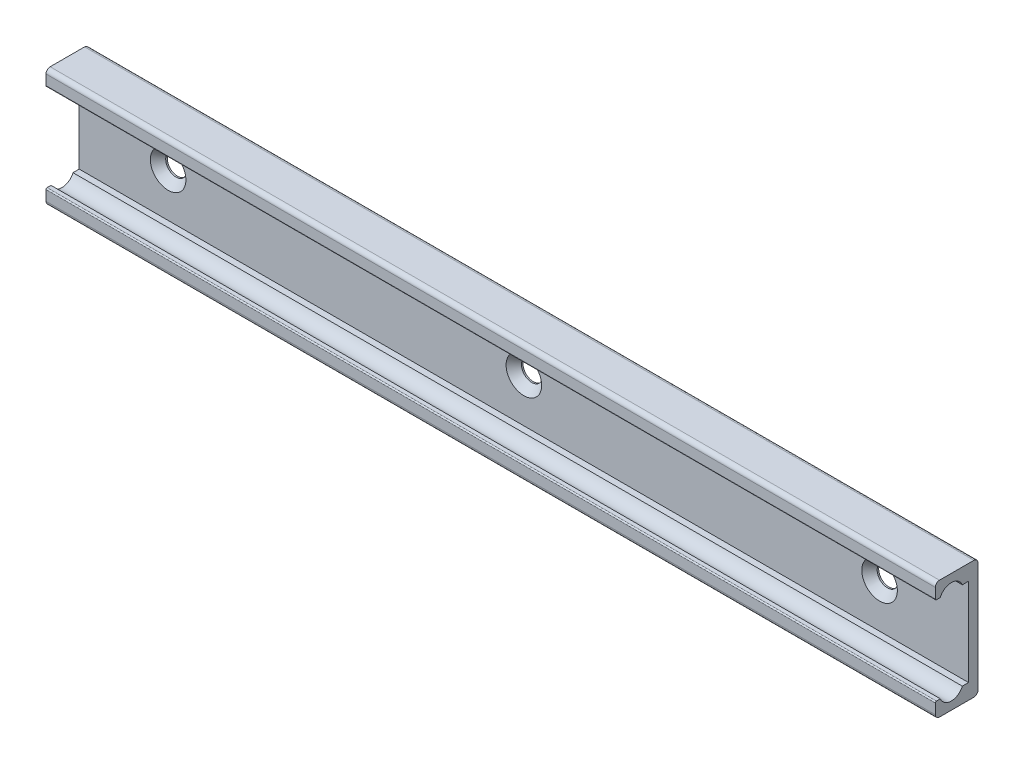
ISO-10303-21;
HEADER;
FILE_DESCRIPTION(('STEP AP214'),'2;1');
FILE_NAME('part.step','',(''),(''),'','','');
FILE_SCHEMA(('AUTOMOTIVE_DESIGN { 1 0 10303 214 1 1 1 1 }'));
ENDSEC;
DATA;
#1=APPLICATION_CONTEXT('core data for automotive mechanical design processes');
#2=APPLICATION_PROTOCOL_DEFINITION('international standard','automotive_design',2000,#1);
#3=PRODUCT_CONTEXT('',#1,'mechanical');
#4=PRODUCT('Part','Part','',(#3));
#5=PRODUCT_RELATED_PRODUCT_CATEGORY('part','',(#4));
#6=PRODUCT_DEFINITION_FORMATION('','',#4);
#7=PRODUCT_DEFINITION_CONTEXT('part definition',#1,'design');
#8=PRODUCT_DEFINITION('design','',#6,#7);
#9=PRODUCT_DEFINITION_SHAPE('','',#8);
#10=(LENGTH_UNIT() NAMED_UNIT(*) SI_UNIT(.MILLI.,.METRE.));
#11=(NAMED_UNIT(*) PLANE_ANGLE_UNIT() SI_UNIT($,.RADIAN.));
#12=(NAMED_UNIT(*) SI_UNIT($,.STERADIAN.) SOLID_ANGLE_UNIT());
#13=UNCERTAINTY_MEASURE_WITH_UNIT(LENGTH_MEASURE(1.E-05),#10,'distance_accuracy_value','');
#14=(GEOMETRIC_REPRESENTATION_CONTEXT(3) GLOBAL_UNCERTAINTY_ASSIGNED_CONTEXT((#13)) GLOBAL_UNIT_ASSIGNED_CONTEXT((#10,
#11,#12)) REPRESENTATION_CONTEXT('',''));
#15=CARTESIAN_POINT('',(0.,0.,0.));
#16=DIRECTION('',(0.,0.,1.));
#17=DIRECTION('',(1.,0.,0.));
#18=AXIS2_PLACEMENT_3D('',#15,#16,#17);
#19=CARTESIAN_POINT('',(135.,9.3,6.49999999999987));
#20=DIRECTION('',(-1.,0.,0.));
#21=DIRECTION('',(0.,0.,1.));
#22=AXIS2_PLACEMENT_3D('',#19,#20,#21);
#23=CYLINDRICAL_SURFACE('',#22,0.7);
#24=CARTESIAN_POINT('',(-15.,9.3,6.49999999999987));
#25=DIRECTION('',(-1.,0.,0.));
#26=DIRECTION('',(0.,0.,-1.));
#27=AXIS2_PLACEMENT_3D('',#24,#25,#26);
#28=CIRCLE('',#27,0.7);
#29=CARTESIAN_POINT('',(-15.,9.3,7.19999999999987));
#30=VERTEX_POINT('',#29);
#31=CARTESIAN_POINT('',(-15.,10.,6.49999999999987));
#32=VERTEX_POINT('',#31);
#33=EDGE_CURVE('E139',#30,#32,#28,.T.);
#34=ORIENTED_EDGE('',*,*,#33,.F.);
#35=DIRECTION('',(-1.,0.,0.));
#36=VECTOR('',#35,1.);
#37=CARTESIAN_POINT('',(135.,9.3,7.19999999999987));
#38=LINE('',#37,#36);
#39=CARTESIAN_POINT('',(135.,9.3,7.19999999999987));
#40=VERTEX_POINT('',#39);
#41=EDGE_CURVE('E9',#40,#30,#38,.T.);
#42=ORIENTED_EDGE('',*,*,#41,.F.);
#43=CARTESIAN_POINT('',(135.,9.3,6.49999999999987));
#44=DIRECTION('',(-1.,0.,0.));
#45=DIRECTION('',(0.,0.,-1.));
#46=AXIS2_PLACEMENT_3D('',#43,#44,#45);
#47=CIRCLE('',#46,0.7);
#48=CARTESIAN_POINT('',(135.,10.,6.49999999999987));
#49=VERTEX_POINT('',#48);
#50=EDGE_CURVE('E141',#40,#49,#47,.T.);
#51=ORIENTED_EDGE('',*,*,#50,.T.);
#52=DIRECTION('',(-1.,0.,0.));
#53=VECTOR('',#52,1.);
#54=CARTESIAN_POINT('',(135.,10.,6.49999999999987));
#55=LINE('',#54,#53);
#56=EDGE_CURVE('E136',#49,#32,#55,.T.);
#57=ORIENTED_EDGE('',*,*,#56,.T.);
#58=EDGE_LOOP('',(#34,#42,#51,#57));
#59=FACE_BOUND('',#58,.T.);
#60=ADVANCED_FACE('F14',(#59),#23,.T.);
#61=CARTESIAN_POINT('',(135.,7.60000008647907,7.19999999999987));
#62=DIRECTION('',(0.,0.,1.));
#63=DIRECTION('',(1.,0.,0.));
#64=AXIS2_PLACEMENT_3D('',#61,#62,#63);
#65=PLANE('',#64);
#66=DIRECTION('',(0.,1.,0.));
#67=VECTOR('',#66,1.);
#68=CARTESIAN_POINT('',(-15.,7.60000008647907,7.19999999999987));
#69=LINE('',#68,#67);
#70=CARTESIAN_POINT('',(-15.,7.60000008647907,7.19999999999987));
#71=VERTEX_POINT('',#70);
#72=EDGE_CURVE('E158',#71,#30,#69,.T.);
#73=ORIENTED_EDGE('',*,*,#72,.F.);
#74=DIRECTION('',(-1.,0.,0.));
#75=VECTOR('',#74,1.);
#76=CARTESIAN_POINT('',(135.,7.60000008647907,7.19999999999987));
#77=LINE('',#76,#75);
#78=CARTESIAN_POINT('',(135.,7.60000008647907,7.19999999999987));
#79=VERTEX_POINT('',#78);
#80=EDGE_CURVE('E22',#79,#71,#77,.T.);
#81=ORIENTED_EDGE('',*,*,#80,.F.);
#82=DIRECTION('',(0.,1.,0.));
#83=VECTOR('',#82,1.);
#84=CARTESIAN_POINT('',(135.,7.60000008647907,7.19999999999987));
#85=LINE('',#84,#83);
#86=EDGE_CURVE('E146',#79,#40,#85,.T.);
#87=ORIENTED_EDGE('',*,*,#86,.T.);
#88=ORIENTED_EDGE('',*,*,#41,.T.);
#89=EDGE_LOOP('',(#73,#81,#87,#88));
#90=FACE_BOUND('',#89,.T.);
#91=ADVANCED_FACE('F386',(#90),#65,.T.);
#92=CARTESIAN_POINT('',(135.,7.60000008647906,6.99999999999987));
#93=DIRECTION('',(-1.,0.,0.));
#94=DIRECTION('',(0.,0.,1.));
#95=AXIS2_PLACEMENT_3D('',#92,#93,#94);
#96=CYLINDRICAL_SURFACE('',#95,0.2);
#97=CARTESIAN_POINT('',(-15.,7.60000008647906,6.99999999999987));
#98=DIRECTION('',(-1.,0.,0.));
#99=DIRECTION('',(0.,0.,-1.));
#100=AXIS2_PLACEMENT_3D('',#97,#98,#99);
#101=CIRCLE('',#100,0.2);
#102=CARTESIAN_POINT('',(-15.,7.40000008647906,6.99999999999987));
#103=VERTEX_POINT('',#102);
#104=EDGE_CURVE('E206',#103,#71,#101,.T.);
#105=ORIENTED_EDGE('',*,*,#104,.F.);
#106=DIRECTION('',(-1.,0.,0.));
#107=VECTOR('',#106,1.);
#108=CARTESIAN_POINT('',(135.,7.40000008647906,6.99999999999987));
#109=LINE('',#108,#107);
#110=CARTESIAN_POINT('',(135.,7.40000008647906,6.99999999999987));
#111=VERTEX_POINT('',#110);
#112=EDGE_CURVE('E258',#111,#103,#109,.T.);
#113=ORIENTED_EDGE('',*,*,#112,.F.);
#114=CARTESIAN_POINT('',(135.,7.60000008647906,6.99999999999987));
#115=DIRECTION('',(-1.,0.,0.));
#116=DIRECTION('',(0.,0.,-1.));
#117=AXIS2_PLACEMENT_3D('',#114,#115,#116);
#118=CIRCLE('',#117,0.2);
#119=EDGE_CURVE('E254',#111,#79,#118,.T.);
#120=ORIENTED_EDGE('',*,*,#119,.T.);
#121=ORIENTED_EDGE('',*,*,#80,.T.);
#122=EDGE_LOOP('',(#105,#113,#120,#121));
#123=FACE_BOUND('',#122,.T.);
#124=ADVANCED_FACE('F391',(#123),#96,.T.);
#125=CARTESIAN_POINT('',(135.,7.40000008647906,6.35404949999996));
#126=DIRECTION('',(0.,-1.,0.));
#127=DIRECTION('',(1.,0.,0.));
#128=AXIS2_PLACEMENT_3D('',#125,#126,#127);
#129=PLANE('',#128);
#130=DIRECTION('',(0.,0.,1.));
#131=VECTOR('',#130,1.);
#132=CARTESIAN_POINT('',(-15.,7.40000008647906,6.35404949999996));
#133=LINE('',#132,#131);
#134=CARTESIAN_POINT('',(-15.,7.40000008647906,6.35404949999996));
#135=VERTEX_POINT('',#134);
#136=EDGE_CURVE('E203',#135,#103,#133,.T.);
#137=ORIENTED_EDGE('',*,*,#136,.F.);
#138=DIRECTION('',(-1.,0.,0.));
#139=VECTOR('',#138,1.);
#140=CARTESIAN_POINT('',(135.,7.40000008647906,6.35404949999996));
#141=LINE('',#140,#139);
#142=CARTESIAN_POINT('',(135.,7.40000008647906,6.35404949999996));
#143=VERTEX_POINT('',#142);
#144=EDGE_CURVE('E260',#143,#135,#141,.T.);
#145=ORIENTED_EDGE('',*,*,#144,.F.);
#146=DIRECTION('',(0.,0.,1.));
#147=VECTOR('',#146,1.);
#148=CARTESIAN_POINT('',(135.,7.40000008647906,6.35404949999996));
#149=LINE('',#148,#147);
#150=EDGE_CURVE('E251',#143,#111,#149,.T.);
#151=ORIENTED_EDGE('',*,*,#150,.T.);
#152=ORIENTED_EDGE('',*,*,#112,.T.);
#153=EDGE_LOOP('',(#137,#145,#151,#152));
#154=FACE_BOUND('',#153,.T.);
#155=ADVANCED_FACE('F397',(#154),#129,.T.);
#156=CARTESIAN_POINT('',(135.,6.65000008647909,4.50000000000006));
#157=DIRECTION('',(-1.,0.,0.));
#158=DIRECTION('',(0.,0.,1.));
#159=AXIS2_PLACEMENT_3D('',#156,#157,#158);
#160=CYLINDRICAL_SURFACE('',#159,1.99999988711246);
#161=CARTESIAN_POINT('',(-15.,6.65000008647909,4.50000000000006));
#162=DIRECTION('',(1.,0.,0.));
#163=DIRECTION('',(0.,0.,1.));
#164=AXIS2_PLACEMENT_3D('',#161,#162,#163);
#165=CIRCLE('',#164,1.99999988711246);
#166=CARTESIAN_POINT('',(-15.,7.40000008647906,2.64595050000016));
#167=VERTEX_POINT('',#166);
#168=EDGE_CURVE('E200',#167,#135,#165,.T.);
#169=ORIENTED_EDGE('',*,*,#168,.F.);
#170=DIRECTION('',(-1.,0.,0.));
#171=VECTOR('',#170,1.);
#172=CARTESIAN_POINT('',(135.,7.40000008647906,2.64595050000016));
#173=LINE('',#172,#171);
#174=CARTESIAN_POINT('',(135.,7.40000008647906,2.64595050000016));
#175=VERTEX_POINT('',#174);
#176=EDGE_CURVE('E262',#175,#167,#173,.T.);
#177=ORIENTED_EDGE('',*,*,#176,.F.);
#178=CARTESIAN_POINT('',(135.,6.65000008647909,4.50000000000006));
#179=DIRECTION('',(1.,0.,0.));
#180=DIRECTION('',(0.,0.,1.));
#181=AXIS2_PLACEMENT_3D('',#178,#179,#180);
#182=CIRCLE('',#181,1.99999988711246);
#183=EDGE_CURVE('E248',#175,#143,#182,.T.);
#184=ORIENTED_EDGE('',*,*,#183,.T.);
#185=ORIENTED_EDGE('',*,*,#144,.T.);
#186=EDGE_LOOP('',(#169,#177,#184,#185));
#187=FACE_BOUND('',#186,.T.);
#188=ADVANCED_FACE('F405',(#187),#160,.F.);
#189=CARTESIAN_POINT('',(135.,7.40000008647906,1.60000000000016));
#190=DIRECTION('',(0.,-1.,0.));
#191=DIRECTION('',(1.,0.,0.));
#192=AXIS2_PLACEMENT_3D('',#189,#190,#191);
#193=PLANE('',#192);
#194=DIRECTION('',(0.,0.,1.));
#195=VECTOR('',#194,1.);
#196=CARTESIAN_POINT('',(-15.,7.40000008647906,1.60000000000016));
#197=LINE('',#196,#195);
#198=CARTESIAN_POINT('',(-15.,7.40000008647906,1.60000000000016));
#199=VERTEX_POINT('',#198);
#200=EDGE_CURVE('E197',#199,#167,#197,.T.);
#201=ORIENTED_EDGE('',*,*,#200,.F.);
#202=DIRECTION('',(-1.,0.,0.));
#203=VECTOR('',#202,1.);
#204=CARTESIAN_POINT('',(135.,7.40000008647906,1.60000000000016));
#205=LINE('',#204,#203);
#206=CARTESIAN_POINT('',(135.,7.40000008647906,1.60000000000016));
#207=VERTEX_POINT('',#206);
#208=EDGE_CURVE('E264',#207,#199,#205,.T.);
#209=ORIENTED_EDGE('',*,*,#208,.F.);
#210=DIRECTION('',(0.,0.,1.));
#211=VECTOR('',#210,1.);
#212=CARTESIAN_POINT('',(135.,7.40000008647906,1.60000000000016));
#213=LINE('',#212,#211);
#214=EDGE_CURVE('E245',#207,#175,#213,.T.);
#215=ORIENTED_EDGE('',*,*,#214,.T.);
#216=ORIENTED_EDGE('',*,*,#176,.T.);
#217=EDGE_LOOP('',(#201,#209,#215,#216));
#218=FACE_BOUND('',#217,.T.);
#219=ADVANCED_FACE('F330',(#218),#193,.T.);
#220=CARTESIAN_POINT('',(135.,-7.40000008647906,1.60000000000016));
#221=DIRECTION('',(0.,0.,1.));
#222=DIRECTION('',(0.,1.,0.));
#223=AXIS2_PLACEMENT_3D('',#220,#221,#222);
#224=PLANE('',#223);
#225=CARTESIAN_POINT('',(120.,0.,1.60000000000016));
#226=DIRECTION('',(0.,0.,1.));
#227=DIRECTION('',(0.,1.,0.));
#228=AXIS2_PLACEMENT_3D('',#225,#226,#227);
#229=CIRCLE('',#228,3.);
#230=CARTESIAN_POINT('',(120.,3.,1.60000000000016));
#231=VERTEX_POINT('',#230);
#232=EDGE_CURVE('E291',#231,#231,#229,.T.);
#233=ORIENTED_EDGE('',*,*,#232,.F.);
#234=EDGE_LOOP('',(#233));
#235=FACE_BOUND('',#234,.T.);
#236=CARTESIAN_POINT('',(60.,0.,1.60000000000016));
#237=DIRECTION('',(0.,0.,1.));
#238=DIRECTION('',(0.,1.,0.));
#239=AXIS2_PLACEMENT_3D('',#236,#237,#238);
#240=CIRCLE('',#239,3.);
#241=CARTESIAN_POINT('',(60.,3.,1.60000000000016));
#242=VERTEX_POINT('',#241);
#243=EDGE_CURVE('E296',#242,#242,#240,.T.);
#244=ORIENTED_EDGE('',*,*,#243,.F.);
#245=EDGE_LOOP('',(#244));
#246=FACE_BOUND('',#245,.T.);
#247=CARTESIAN_POINT('',(0.,0.,1.60000000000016));
#248=DIRECTION('',(0.,0.,1.));
#249=DIRECTION('',(0.,1.,0.));
#250=AXIS2_PLACEMENT_3D('',#247,#248,#249);
#251=CIRCLE('',#250,3.);
#252=CARTESIAN_POINT('',(0.,3.,1.60000000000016));
#253=VERTEX_POINT('',#252);
#254=EDGE_CURVE('E159',#253,#253,#251,.T.);
#255=ORIENTED_EDGE('',*,*,#254,.F.);
#256=EDGE_LOOP('',(#255));
#257=FACE_BOUND('',#256,.T.);
#258=DIRECTION('',(0.,1.,0.));
#259=VECTOR('',#258,1.);
#260=CARTESIAN_POINT('',(-15.,-7.40000008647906,1.60000000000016));
#261=LINE('',#260,#259);
#262=CARTESIAN_POINT('',(-15.,-7.40000008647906,1.60000000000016));
#263=VERTEX_POINT('',#262);
#264=EDGE_CURVE('E194',#263,#199,#261,.T.);
#265=ORIENTED_EDGE('',*,*,#264,.F.);
#266=DIRECTION('',(-1.,0.,0.));
#267=VECTOR('',#266,1.);
#268=CARTESIAN_POINT('',(135.,-7.40000008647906,1.60000000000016));
#269=LINE('',#268,#267);
#270=CARTESIAN_POINT('',(135.,-7.40000008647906,1.60000000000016));
#271=VERTEX_POINT('',#270);
#272=EDGE_CURVE('E266',#271,#263,#269,.T.);
#273=ORIENTED_EDGE('',*,*,#272,.F.);
#274=DIRECTION('',(0.,1.,0.));
#275=VECTOR('',#274,1.);
#276=CARTESIAN_POINT('',(135.,-7.40000008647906,1.60000000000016));
#277=LINE('',#276,#275);
#278=EDGE_CURVE('E242',#271,#207,#277,.T.);
#279=ORIENTED_EDGE('',*,*,#278,.T.);
#280=ORIENTED_EDGE('',*,*,#208,.T.);
#281=EDGE_LOOP('',(#265,#273,#279,#280));
#282=FACE_BOUND('',#281,.T.);
#283=ADVANCED_FACE('F326',(#235,#246,#257,#282),#224,.T.);
#284=CARTESIAN_POINT('',(135.,-7.40000008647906,1.60000000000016));
#285=DIRECTION('',(0.,1.,0.));
#286=DIRECTION('',(-1.,0.,0.));
#287=AXIS2_PLACEMENT_3D('',#284,#285,#286);
#288=PLANE('',#287);
#289=DIRECTION('',(0.,0.,-1.));
#290=VECTOR('',#289,1.);
#291=CARTESIAN_POINT('',(-15.,-7.40000008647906,1.60000000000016));
#292=LINE('',#291,#290);
#293=CARTESIAN_POINT('',(-15.,-7.40000008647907,2.64595050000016));
#294=VERTEX_POINT('',#293);
#295=EDGE_CURVE('E191',#294,#263,#292,.T.);
#296=ORIENTED_EDGE('',*,*,#295,.F.);
#297=DIRECTION('',(-1.,0.,0.));
#298=VECTOR('',#297,1.);
#299=CARTESIAN_POINT('',(135.,-7.40000008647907,2.64595050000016));
#300=LINE('',#299,#298);
#301=CARTESIAN_POINT('',(135.,-7.40000008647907,2.64595050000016));
#302=VERTEX_POINT('',#301);
#303=EDGE_CURVE('E268',#302,#294,#300,.T.);
#304=ORIENTED_EDGE('',*,*,#303,.F.);
#305=DIRECTION('',(0.,0.,-1.));
#306=VECTOR('',#305,1.);
#307=CARTESIAN_POINT('',(135.,-7.40000008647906,1.60000000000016));
#308=LINE('',#307,#306);
#309=EDGE_CURVE('E239',#302,#271,#308,.T.);
#310=ORIENTED_EDGE('',*,*,#309,.T.);
#311=ORIENTED_EDGE('',*,*,#272,.T.);
#312=EDGE_LOOP('',(#296,#304,#310,#311));
#313=FACE_BOUND('',#312,.T.);
#314=ADVANCED_FACE('F329',(#313),#288,.T.);
#315=CARTESIAN_POINT('',(135.,-6.65000008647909,4.50000000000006));
#316=DIRECTION('',(-1.,0.,0.));
#317=DIRECTION('',(0.,0.,1.));
#318=AXIS2_PLACEMENT_3D('',#315,#316,#317);
#319=CYLINDRICAL_SURFACE('',#318,1.99999988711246);
#320=CARTESIAN_POINT('',(-15.,-6.65000008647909,4.50000000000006));
#321=DIRECTION('',(1.,0.,0.));
#322=DIRECTION('',(0.,0.,-1.));
#323=AXIS2_PLACEMENT_3D('',#320,#321,#322);
#324=CIRCLE('',#323,1.99999988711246);
#325=CARTESIAN_POINT('',(-15.,-7.40000008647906,6.35404949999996));
#326=VERTEX_POINT('',#325);
#327=EDGE_CURVE('E188',#326,#294,#324,.T.);
#328=ORIENTED_EDGE('',*,*,#327,.F.);
#329=DIRECTION('',(-1.,0.,0.));
#330=VECTOR('',#329,1.);
#331=CARTESIAN_POINT('',(135.,-7.40000008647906,6.35404949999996));
#332=LINE('',#331,#330);
#333=CARTESIAN_POINT('',(135.,-7.40000008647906,6.35404949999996));
#334=VERTEX_POINT('',#333);
#335=EDGE_CURVE('E270',#334,#326,#332,.T.);
#336=ORIENTED_EDGE('',*,*,#335,.F.);
#337=CARTESIAN_POINT('',(135.,-6.65000008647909,4.50000000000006));
#338=DIRECTION('',(1.,0.,0.));
#339=DIRECTION('',(0.,0.,-1.));
#340=AXIS2_PLACEMENT_3D('',#337,#338,#339);
#341=CIRCLE('',#340,1.99999988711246);
#342=EDGE_CURVE('E236',#334,#302,#341,.T.);
#343=ORIENTED_EDGE('',*,*,#342,.T.);
#344=ORIENTED_EDGE('',*,*,#303,.T.);
#345=EDGE_LOOP('',(#328,#336,#343,#344));
#346=FACE_BOUND('',#345,.T.);
#347=ADVANCED_FACE('F346',(#346),#319,.F.);
#348=CARTESIAN_POINT('',(135.,-7.40000008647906,6.35404949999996));
#349=DIRECTION('',(0.,1.,0.));
#350=DIRECTION('',(-1.,0.,0.));
#351=AXIS2_PLACEMENT_3D('',#348,#349,#350);
#352=PLANE('',#351);
#353=DIRECTION('',(0.,0.,-1.));
#354=VECTOR('',#353,1.);
#355=CARTESIAN_POINT('',(-15.,-7.40000008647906,6.35404949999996));
#356=LINE('',#355,#354);
#357=CARTESIAN_POINT('',(-15.,-7.40000008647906,6.99999999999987));
#358=VERTEX_POINT('',#357);
#359=EDGE_CURVE('E185',#358,#326,#356,.T.);
#360=ORIENTED_EDGE('',*,*,#359,.F.);
#361=DIRECTION('',(-1.,0.,0.));
#362=VECTOR('',#361,1.);
#363=CARTESIAN_POINT('',(135.,-7.40000008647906,6.99999999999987));
#364=LINE('',#363,#362);
#365=CARTESIAN_POINT('',(135.,-7.40000008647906,6.99999999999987));
#366=VERTEX_POINT('',#365);
#367=EDGE_CURVE('E272',#366,#358,#364,.T.);
#368=ORIENTED_EDGE('',*,*,#367,.F.);
#369=DIRECTION('',(0.,0.,-1.));
#370=VECTOR('',#369,1.);
#371=CARTESIAN_POINT('',(135.,-7.40000008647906,6.35404949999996));
#372=LINE('',#371,#370);
#373=EDGE_CURVE('E233',#366,#334,#372,.T.);
#374=ORIENTED_EDGE('',*,*,#373,.T.);
#375=ORIENTED_EDGE('',*,*,#335,.T.);
#376=EDGE_LOOP('',(#360,#368,#374,#375));
#377=FACE_BOUND('',#376,.T.);
#378=ADVANCED_FACE('F349',(#377),#352,.T.);
#379=CARTESIAN_POINT('',(135.,-7.60000008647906,6.99999999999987));
#380=DIRECTION('',(-1.,0.,0.));
#381=DIRECTION('',(0.,0.,1.));
#382=AXIS2_PLACEMENT_3D('',#379,#380,#381);
#383=CYLINDRICAL_SURFACE('',#382,0.2);
#384=CARTESIAN_POINT('',(-15.,-7.60000008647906,6.99999999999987));
#385=DIRECTION('',(-1.,0.,0.));
#386=DIRECTION('',(0.,0.,1.));
#387=AXIS2_PLACEMENT_3D('',#384,#385,#386);
#388=CIRCLE('',#387,0.2);
#389=CARTESIAN_POINT('',(-15.,-7.60000008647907,7.19999999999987));
#390=VERTEX_POINT('',#389);
#391=EDGE_CURVE('E182',#390,#358,#388,.T.);
#392=ORIENTED_EDGE('',*,*,#391,.F.);
#393=DIRECTION('',(-1.,0.,0.));
#394=VECTOR('',#393,1.);
#395=CARTESIAN_POINT('',(135.,-7.60000008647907,7.19999999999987));
#396=LINE('',#395,#394);
#397=CARTESIAN_POINT('',(135.,-7.60000008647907,7.19999999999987));
#398=VERTEX_POINT('',#397);
#399=EDGE_CURVE('E274',#398,#390,#396,.T.);
#400=ORIENTED_EDGE('',*,*,#399,.F.);
#401=CARTESIAN_POINT('',(135.,-7.60000008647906,6.99999999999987));
#402=DIRECTION('',(-1.,0.,0.));
#403=DIRECTION('',(0.,0.,1.));
#404=AXIS2_PLACEMENT_3D('',#401,#402,#403);
#405=CIRCLE('',#404,0.2);
#406=EDGE_CURVE('E230',#398,#366,#405,.T.);
#407=ORIENTED_EDGE('',*,*,#406,.T.);
#408=ORIENTED_EDGE('',*,*,#367,.T.);
#409=EDGE_LOOP('',(#392,#400,#407,#408));
#410=FACE_BOUND('',#409,.T.);
#411=ADVANCED_FACE('F354',(#410),#383,.T.);
#412=CARTESIAN_POINT('',(135.,-7.60000008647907,7.19999999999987));
#413=DIRECTION('',(0.,0.,1.));
#414=DIRECTION('',(1.,0.,0.));
#415=AXIS2_PLACEMENT_3D('',#412,#413,#414);
#416=PLANE('',#415);
#417=DIRECTION('',(0.,1.,0.));
#418=VECTOR('',#417,1.);
#419=CARTESIAN_POINT('',(-15.,-7.60000008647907,7.19999999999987));
#420=LINE('',#419,#418);
#421=CARTESIAN_POINT('',(-15.,-9.3,7.19999999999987));
#422=VERTEX_POINT('',#421);
#423=EDGE_CURVE('E179',#422,#390,#420,.T.);
#424=ORIENTED_EDGE('',*,*,#423,.F.);
#425=DIRECTION('',(-1.,0.,0.));
#426=VECTOR('',#425,1.);
#427=CARTESIAN_POINT('',(135.,-9.3,7.19999999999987));
#428=LINE('',#427,#426);
#429=CARTESIAN_POINT('',(135.,-9.3,7.19999999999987));
#430=VERTEX_POINT('',#429);
#431=EDGE_CURVE('E276',#430,#422,#428,.T.);
#432=ORIENTED_EDGE('',*,*,#431,.F.);
#433=DIRECTION('',(0.,1.,0.));
#434=VECTOR('',#433,1.);
#435=CARTESIAN_POINT('',(135.,-7.60000008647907,7.19999999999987));
#436=LINE('',#435,#434);
#437=EDGE_CURVE('E227',#430,#398,#436,.T.);
#438=ORIENTED_EDGE('',*,*,#437,.T.);
#439=ORIENTED_EDGE('',*,*,#399,.T.);
#440=EDGE_LOOP('',(#424,#432,#438,#439));
#441=FACE_BOUND('',#440,.T.);
#442=ADVANCED_FACE('F357',(#441),#416,.T.);
#443=CARTESIAN_POINT('',(135.,-9.3,6.49999999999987));
#444=DIRECTION('',(-1.,0.,0.));
#445=DIRECTION('',(0.,0.,1.));
#446=AXIS2_PLACEMENT_3D('',#443,#444,#445);
#447=CYLINDRICAL_SURFACE('',#446,0.7);
#448=CARTESIAN_POINT('',(-15.,-9.3,6.49999999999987));
#449=DIRECTION('',(-1.,0.,0.));
#450=DIRECTION('',(0.,0.,1.));
#451=AXIS2_PLACEMENT_3D('',#448,#449,#450);
#452=CIRCLE('',#451,0.7);
#453=CARTESIAN_POINT('',(-15.,-10.,6.49999999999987));
#454=VERTEX_POINT('',#453);
#455=EDGE_CURVE('E176',#454,#422,#452,.T.);
#456=ORIENTED_EDGE('',*,*,#455,.F.);
#457=DIRECTION('',(-1.,0.,0.));
#458=VECTOR('',#457,1.);
#459=CARTESIAN_POINT('',(135.,-10.,6.49999999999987));
#460=LINE('',#459,#458);
#461=CARTESIAN_POINT('',(135.,-10.,6.49999999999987));
#462=VERTEX_POINT('',#461);
#463=EDGE_CURVE('E278',#462,#454,#460,.T.);
#464=ORIENTED_EDGE('',*,*,#463,.F.);
#465=CARTESIAN_POINT('',(135.,-9.3,6.49999999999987));
#466=DIRECTION('',(-1.,0.,0.));
#467=DIRECTION('',(0.,0.,1.));
#468=AXIS2_PLACEMENT_3D('',#465,#466,#467);
#469=CIRCLE('',#468,0.7);
#470=EDGE_CURVE('E224',#462,#430,#469,.T.);
#471=ORIENTED_EDGE('',*,*,#470,.T.);
#472=ORIENTED_EDGE('',*,*,#431,.T.);
#473=EDGE_LOOP('',(#456,#464,#471,#472));
#474=FACE_BOUND('',#473,.T.);
#475=ADVANCED_FACE('F362',(#474),#447,.T.);
#476=CARTESIAN_POINT('',(135.,-10.,0.7));
#477=DIRECTION('',(0.,-1.,0.));
#478=DIRECTION('',(1.,0.,0.));
#479=AXIS2_PLACEMENT_3D('',#476,#477,#478);
#480=PLANE('',#479);
#481=DIRECTION('',(0.,0.,1.));
#482=VECTOR('',#481,1.);
#483=CARTESIAN_POINT('',(-15.,-10.,0.7));
#484=LINE('',#483,#482);
#485=CARTESIAN_POINT('',(-15.,-10.,0.7));
#486=VERTEX_POINT('',#485);
#487=EDGE_CURVE('E173',#486,#454,#484,.T.);
#488=ORIENTED_EDGE('',*,*,#487,.F.);
#489=DIRECTION('',(-1.,0.,0.));
#490=VECTOR('',#489,1.);
#491=CARTESIAN_POINT('',(135.,-10.,0.7));
#492=LINE('',#491,#490);
#493=CARTESIAN_POINT('',(135.,-10.,0.7));
#494=VERTEX_POINT('',#493);
#495=EDGE_CURVE('E280',#494,#486,#492,.T.);
#496=ORIENTED_EDGE('',*,*,#495,.F.);
#497=DIRECTION('',(0.,0.,1.));
#498=VECTOR('',#497,1.);
#499=CARTESIAN_POINT('',(135.,-10.,0.7));
#500=LINE('',#499,#498);
#501=EDGE_CURVE('E221',#494,#462,#500,.T.);
#502=ORIENTED_EDGE('',*,*,#501,.T.);
#503=ORIENTED_EDGE('',*,*,#463,.T.);
#504=EDGE_LOOP('',(#488,#496,#502,#503));
#505=FACE_BOUND('',#504,.T.);
#506=ADVANCED_FACE('F365',(#505),#480,.T.);
#507=CARTESIAN_POINT('',(135.,-9.3,0.7));
#508=DIRECTION('',(-1.,0.,0.));
#509=DIRECTION('',(0.,0.,1.));
#510=AXIS2_PLACEMENT_3D('',#507,#508,#509);
#511=CYLINDRICAL_SURFACE('',#510,0.7);
#512=CARTESIAN_POINT('',(-15.,-9.3,0.7));
#513=DIRECTION('',(-1.,0.,0.));
#514=DIRECTION('',(0.,0.,1.));
#515=AXIS2_PLACEMENT_3D('',#512,#513,#514);
#516=CIRCLE('',#515,0.7);
#517=CARTESIAN_POINT('',(-15.,-9.3,0.));
#518=VERTEX_POINT('',#517);
#519=EDGE_CURVE('E170',#518,#486,#516,.T.);
#520=ORIENTED_EDGE('',*,*,#519,.F.);
#521=DIRECTION('',(-1.,0.,0.));
#522=VECTOR('',#521,1.);
#523=CARTESIAN_POINT('',(135.,-9.3,0.));
#524=LINE('',#523,#522);
#525=CARTESIAN_POINT('',(135.,-9.3,0.));
#526=VERTEX_POINT('',#525);
#527=EDGE_CURVE('E282',#526,#518,#524,.T.);
#528=ORIENTED_EDGE('',*,*,#527,.F.);
#529=CARTESIAN_POINT('',(135.,-9.3,0.7));
#530=DIRECTION('',(-1.,0.,0.));
#531=DIRECTION('',(0.,0.,1.));
#532=AXIS2_PLACEMENT_3D('',#529,#530,#531);
#533=CIRCLE('',#532,0.7);
#534=EDGE_CURVE('E218',#526,#494,#533,.T.);
#535=ORIENTED_EDGE('',*,*,#534,.T.);
#536=ORIENTED_EDGE('',*,*,#495,.T.);
#537=EDGE_LOOP('',(#520,#528,#535,#536));
#538=FACE_BOUND('',#537,.T.);
#539=ADVANCED_FACE('F370',(#538),#511,.T.);
#540=CARTESIAN_POINT('',(135.,-9.3,0.));
#541=DIRECTION('',(0.,0.,-1.));
#542=DIRECTION('',(-1.,0.,0.));
#543=AXIS2_PLACEMENT_3D('',#540,#541,#542);
#544=PLANE('',#543);
#545=CARTESIAN_POINT('',(120.,0.,0.));
#546=DIRECTION('',(0.,0.,1.));
#547=DIRECTION('',(0.,1.,0.));
#548=AXIS2_PLACEMENT_3D('',#545,#546,#547);
#549=CIRCLE('',#548,1.75);
#550=CARTESIAN_POINT('',(120.,1.75,0.));
#551=VERTEX_POINT('',#550);
#552=EDGE_CURVE('E303',#551,#551,#549,.T.);
#553=ORIENTED_EDGE('',*,*,#552,.T.);
#554=EDGE_LOOP('',(#553));
#555=FACE_BOUND('',#554,.T.);
#556=CARTESIAN_POINT('',(60.,0.,0.));
#557=DIRECTION('',(0.,0.,1.));
#558=DIRECTION('',(0.,1.,0.));
#559=AXIS2_PLACEMENT_3D('',#556,#557,#558);
#560=CIRCLE('',#559,1.75);
#561=CARTESIAN_POINT('',(60.,1.75,0.));
#562=VERTEX_POINT('',#561);
#563=EDGE_CURVE('E292',#562,#562,#560,.T.);
#564=ORIENTED_EDGE('',*,*,#563,.T.);
#565=EDGE_LOOP('',(#564));
#566=FACE_BOUND('',#565,.T.);
#567=CARTESIAN_POINT('',(0.,0.,0.));
#568=DIRECTION('',(0.,0.,1.));
#569=DIRECTION('',(0.,1.,0.));
#570=AXIS2_PLACEMENT_3D('',#567,#568,#569);
#571=CIRCLE('',#570,1.75);
#572=CARTESIAN_POINT('',(0.,1.75,0.));
#573=VERTEX_POINT('',#572);
#574=EDGE_CURVE('E288',#573,#573,#571,.T.);
#575=ORIENTED_EDGE('',*,*,#574,.T.);
#576=EDGE_LOOP('',(#575));
#577=FACE_BOUND('',#576,.T.);
#578=DIRECTION('',(0.,-1.,0.));
#579=VECTOR('',#578,1.);
#580=CARTESIAN_POINT('',(-15.,-9.3,0.));
#581=LINE('',#580,#579);
#582=CARTESIAN_POINT('',(-15.,9.3,0.));
#583=VERTEX_POINT('',#582);
#584=EDGE_CURVE('E167',#583,#518,#581,.T.);
#585=ORIENTED_EDGE('',*,*,#584,.F.);
#586=DIRECTION('',(-1.,0.,0.));
#587=VECTOR('',#586,1.);
#588=CARTESIAN_POINT('',(135.,9.3,0.));
#589=LINE('',#588,#587);
#590=CARTESIAN_POINT('',(135.,9.3,0.));
#591=VERTEX_POINT('',#590);
#592=EDGE_CURVE('E284',#591,#583,#589,.T.);
#593=ORIENTED_EDGE('',*,*,#592,.F.);
#594=DIRECTION('',(0.,-1.,0.));
#595=VECTOR('',#594,1.);
#596=CARTESIAN_POINT('',(135.,-9.3,0.));
#597=LINE('',#596,#595);
#598=EDGE_CURVE('E215',#591,#526,#597,.T.);
#599=ORIENTED_EDGE('',*,*,#598,.T.);
#600=ORIENTED_EDGE('',*,*,#527,.T.);
#601=EDGE_LOOP('',(#585,#593,#599,#600));
#602=FACE_BOUND('',#601,.T.);
#603=ADVANCED_FACE('F310',(#555,#566,#577,#602),#544,.T.);
#604=CARTESIAN_POINT('',(135.,9.3,0.7));
#605=DIRECTION('',(-1.,0.,0.));
#606=DIRECTION('',(0.,0.,1.));
#607=AXIS2_PLACEMENT_3D('',#604,#605,#606);
#608=CYLINDRICAL_SURFACE('',#607,0.7);
#609=CARTESIAN_POINT('',(-15.,9.3,0.7));
#610=DIRECTION('',(-1.,0.,0.));
#611=DIRECTION('',(0.,0.,-1.));
#612=AXIS2_PLACEMENT_3D('',#609,#610,#611);
#613=CIRCLE('',#612,0.7);
#614=CARTESIAN_POINT('',(-15.,10.,0.7));
#615=VERTEX_POINT('',#614);
#616=EDGE_CURVE('E154',#615,#583,#613,.T.);
#617=ORIENTED_EDGE('',*,*,#616,.F.);
#618=DIRECTION('',(-1.,0.,0.));
#619=VECTOR('',#618,1.);
#620=CARTESIAN_POINT('',(135.,10.,0.7));
#621=LINE('',#620,#619);
#622=CARTESIAN_POINT('',(135.,10.,0.7));
#623=VERTEX_POINT('',#622);
#624=EDGE_CURVE('E145',#623,#615,#621,.T.);
#625=ORIENTED_EDGE('',*,*,#624,.F.);
#626=CARTESIAN_POINT('',(135.,9.3,0.7));
#627=DIRECTION('',(-1.,0.,0.));
#628=DIRECTION('',(0.,0.,-1.));
#629=AXIS2_PLACEMENT_3D('',#626,#627,#628);
#630=CIRCLE('',#629,0.7);
#631=EDGE_CURVE('E212',#623,#591,#630,.T.);
#632=ORIENTED_EDGE('',*,*,#631,.T.);
#633=ORIENTED_EDGE('',*,*,#592,.T.);
#634=EDGE_LOOP('',(#617,#625,#632,#633));
#635=FACE_BOUND('',#634,.T.);
#636=ADVANCED_FACE('F374',(#635),#608,.T.);
#637=CARTESIAN_POINT('',(135.,10.,0.7));
#638=DIRECTION('',(0.,1.,0.));
#639=DIRECTION('',(-1.,0.,0.));
#640=AXIS2_PLACEMENT_3D('',#637,#638,#639);
#641=PLANE('',#640);
#642=DIRECTION('',(0.,0.,-1.));
#643=VECTOR('',#642,1.);
#644=CARTESIAN_POINT('',(-15.,10.,0.7));
#645=LINE('',#644,#643);
#646=EDGE_CURVE('E149',#32,#615,#645,.T.);
#647=ORIENTED_EDGE('',*,*,#646,.F.);
#648=ORIENTED_EDGE('',*,*,#56,.F.);
#649=DIRECTION('',(0.,0.,-1.));
#650=VECTOR('',#649,1.);
#651=CARTESIAN_POINT('',(135.,10.,0.7));
#652=LINE('',#651,#650);
#653=EDGE_CURVE('E210',#49,#623,#652,.T.);
#654=ORIENTED_EDGE('',*,*,#653,.T.);
#655=ORIENTED_EDGE('',*,*,#624,.T.);
#656=EDGE_LOOP('',(#647,#648,#654,#655));
#657=FACE_BOUND('',#656,.T.);
#658=ADVANCED_FACE('F150',(#657),#641,.T.);
#659=CARTESIAN_POINT('',(135.,9.3,6.49999999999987));
#660=DIRECTION('',(1.,0.,0.));
#661=DIRECTION('',(0.,0.,-1.));
#662=AXIS2_PLACEMENT_3D('',#659,#660,#661);
#663=PLANE('',#662);
#664=ORIENTED_EDGE('',*,*,#50,.F.);
#665=ORIENTED_EDGE('',*,*,#86,.F.);
#666=ORIENTED_EDGE('',*,*,#119,.F.);
#667=ORIENTED_EDGE('',*,*,#150,.F.);
#668=ORIENTED_EDGE('',*,*,#183,.F.);
#669=ORIENTED_EDGE('',*,*,#214,.F.);
#670=ORIENTED_EDGE('',*,*,#278,.F.);
#671=ORIENTED_EDGE('',*,*,#309,.F.);
#672=ORIENTED_EDGE('',*,*,#342,.F.);
#673=ORIENTED_EDGE('',*,*,#373,.F.);
#674=ORIENTED_EDGE('',*,*,#406,.F.);
#675=ORIENTED_EDGE('',*,*,#437,.F.);
#676=ORIENTED_EDGE('',*,*,#470,.F.);
#677=ORIENTED_EDGE('',*,*,#501,.F.);
#678=ORIENTED_EDGE('',*,*,#534,.F.);
#679=ORIENTED_EDGE('',*,*,#598,.F.);
#680=ORIENTED_EDGE('',*,*,#631,.F.);
#681=ORIENTED_EDGE('',*,*,#653,.F.);
#682=EDGE_LOOP('',(#664,#665,#666,#667,#668,#669,#670,#671,#672,#673,#674,#675,#676,#677,#678,
#679,#680,#681));
#683=FACE_BOUND('',#682,.T.);
#684=ADVANCED_FACE('F342',(#683),#663,.T.);
#685=CARTESIAN_POINT('',(-15.,9.3,6.49999999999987));
#686=DIRECTION('',(1.,0.,0.));
#687=DIRECTION('',(0.,0.,-1.));
#688=AXIS2_PLACEMENT_3D('',#685,#686,#687);
#689=PLANE('',#688);
#690=ORIENTED_EDGE('',*,*,#33,.T.);
#691=ORIENTED_EDGE('',*,*,#646,.T.);
#692=ORIENTED_EDGE('',*,*,#616,.T.);
#693=ORIENTED_EDGE('',*,*,#584,.T.);
#694=ORIENTED_EDGE('',*,*,#519,.T.);
#695=ORIENTED_EDGE('',*,*,#487,.T.);
#696=ORIENTED_EDGE('',*,*,#455,.T.);
#697=ORIENTED_EDGE('',*,*,#423,.T.);
#698=ORIENTED_EDGE('',*,*,#391,.T.);
#699=ORIENTED_EDGE('',*,*,#359,.T.);
#700=ORIENTED_EDGE('',*,*,#327,.T.);
#701=ORIENTED_EDGE('',*,*,#295,.T.);
#702=ORIENTED_EDGE('',*,*,#264,.T.);
#703=ORIENTED_EDGE('',*,*,#200,.T.);
#704=ORIENTED_EDGE('',*,*,#168,.T.);
#705=ORIENTED_EDGE('',*,*,#136,.T.);
#706=ORIENTED_EDGE('',*,*,#104,.T.);
#707=ORIENTED_EDGE('',*,*,#72,.T.);
#708=EDGE_LOOP('',(#690,#691,#692,#693,#694,#695,#696,#697,#698,#699,#700,#701,#702,#703,#704,
#705,#706,#707));
#709=FACE_BOUND('',#708,.T.);
#710=ADVANCED_FACE('F156',(#709),#689,.F.);
#711=CARTESIAN_POINT('',(0.,0.,1.60000000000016));
#712=DIRECTION('',(0.,0.,1.));
#713=DIRECTION('',(0.,1.,0.));
#714=AXIS2_PLACEMENT_3D('',#711,#712,#713);
#715=CONICAL_SURFACE('',#714,3.,0.750491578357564);
#716=CARTESIAN_POINT('',(0.,0.,0.259539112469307));
#717=DIRECTION('',(0.,0.,1.));
#718=DIRECTION('',(0.,1.,0.));
#719=AXIS2_PLACEMENT_3D('',#716,#717,#718);
#720=CIRCLE('',#719,1.75);
#721=CARTESIAN_POINT('',(0.,1.75,0.259539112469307));
#722=VERTEX_POINT('',#721);
#723=EDGE_CURVE('E162',#722,#722,#720,.F.);
#724=ORIENTED_EDGE('',*,*,#723,.T.);
#725=EDGE_LOOP('',(#724));
#726=FACE_BOUND('',#725,.T.);
#727=ORIENTED_EDGE('',*,*,#254,.T.);
#728=EDGE_LOOP('',(#727));
#729=FACE_BOUND('',#728,.T.);
#730=ADVANCED_FACE('F317',(#726,#729),#715,.F.);
#731=CARTESIAN_POINT('',(0.,0.,0.));
#732=DIRECTION('',(0.,0.,1.));
#733=DIRECTION('',(0.,1.,0.));
#734=AXIS2_PLACEMENT_3D('',#731,#732,#733);
#735=CYLINDRICAL_SURFACE('',#734,1.75);
#736=ORIENTED_EDGE('',*,*,#574,.F.);
#737=EDGE_LOOP('',(#736));
#738=FACE_BOUND('',#737,.T.);
#739=ORIENTED_EDGE('',*,*,#723,.F.);
#740=EDGE_LOOP('',(#739));
#741=FACE_BOUND('',#740,.T.);
#742=ADVANCED_FACE('F313',(#738,#741),#735,.F.);
#743=CARTESIAN_POINT('',(60.,0.,1.60000000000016));
#744=DIRECTION('',(0.,0.,1.));
#745=DIRECTION('',(0.,1.,0.));
#746=AXIS2_PLACEMENT_3D('',#743,#744,#745);
#747=CONICAL_SURFACE('',#746,3.,0.750491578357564);
#748=CARTESIAN_POINT('',(60.,0.,0.259539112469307));
#749=DIRECTION('',(0.,0.,1.));
#750=DIRECTION('',(0.,1.,0.));
#751=AXIS2_PLACEMENT_3D('',#748,#749,#750);
#752=CIRCLE('',#751,1.75);
#753=CARTESIAN_POINT('',(60.,1.75,0.259539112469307));
#754=VERTEX_POINT('',#753);
#755=EDGE_CURVE('E289',#754,#754,#752,.F.);
#756=ORIENTED_EDGE('',*,*,#755,.T.);
#757=EDGE_LOOP('',(#756));
#758=FACE_BOUND('',#757,.T.);
#759=ORIENTED_EDGE('',*,*,#243,.T.);
#760=EDGE_LOOP('',(#759));
#761=FACE_BOUND('',#760,.T.);
#762=ADVANCED_FACE('F316',(#758,#761),#747,.F.);
#763=CARTESIAN_POINT('',(120.,0.,1.60000000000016));
#764=DIRECTION('',(0.,0.,1.));
#765=DIRECTION('',(0.,1.,0.));
#766=AXIS2_PLACEMENT_3D('',#763,#764,#765);
#767=CONICAL_SURFACE('',#766,3.,0.750491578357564);
#768=CARTESIAN_POINT('',(120.,0.,0.259539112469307));
#769=DIRECTION('',(0.,0.,1.));
#770=DIRECTION('',(0.,1.,0.));
#771=AXIS2_PLACEMENT_3D('',#768,#769,#770);
#772=CIRCLE('',#771,1.75);
#773=CARTESIAN_POINT('',(120.,1.75,0.259539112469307));
#774=VERTEX_POINT('',#773);
#775=EDGE_CURVE('E17',#774,#774,#772,.F.);
#776=ORIENTED_EDGE('',*,*,#775,.T.);
#777=EDGE_LOOP('',(#776));
#778=FACE_BOUND('',#777,.T.);
#779=ORIENTED_EDGE('',*,*,#232,.T.);
#780=EDGE_LOOP('',(#779));
#781=FACE_BOUND('',#780,.T.);
#782=ADVANCED_FACE('F555',(#778,#781),#767,.F.);
#783=CARTESIAN_POINT('',(60.,0.,0.));
#784=DIRECTION('',(0.,0.,1.));
#785=DIRECTION('',(0.,1.,0.));
#786=AXIS2_PLACEMENT_3D('',#783,#784,#785);
#787=CYLINDRICAL_SURFACE('',#786,1.75);
#788=ORIENTED_EDGE('',*,*,#563,.F.);
#789=EDGE_LOOP('',(#788));
#790=FACE_BOUND('',#789,.T.);
#791=ORIENTED_EDGE('',*,*,#755,.F.);
#792=EDGE_LOOP('',(#791));
#793=FACE_BOUND('',#792,.T.);
#794=ADVANCED_FACE('F562',(#790,#793),#787,.F.);
#795=CARTESIAN_POINT('',(120.,0.,0.));
#796=DIRECTION('',(0.,0.,1.));
#797=DIRECTION('',(0.,1.,0.));
#798=AXIS2_PLACEMENT_3D('',#795,#796,#797);
#799=CYLINDRICAL_SURFACE('',#798,1.75);
#800=ORIENTED_EDGE('',*,*,#552,.F.);
#801=EDGE_LOOP('',(#800));
#802=FACE_BOUND('',#801,.T.);
#803=ORIENTED_EDGE('',*,*,#775,.F.);
#804=EDGE_LOOP('',(#803));
#805=FACE_BOUND('',#804,.T.);
#806=ADVANCED_FACE('F570',(#802,#805),#799,.F.);
#807=CLOSED_SHELL('',(#60,#91,#124,#155,#188,#219,#283,#314,#347,#378,#411,#442,#475,#506,#539,
#603,#636,#658,#684,#710,#730,#742,#762,#782,#794,#806));
#808=MANIFOLD_SOLID_BREP('B1',#807);
#809=ADVANCED_BREP_SHAPE_REPRESENTATION('',(#18,#808),#14);
#810=SHAPE_DEFINITION_REPRESENTATION(#9,#809);
ENDSEC;
END-ISO-10303-21;
